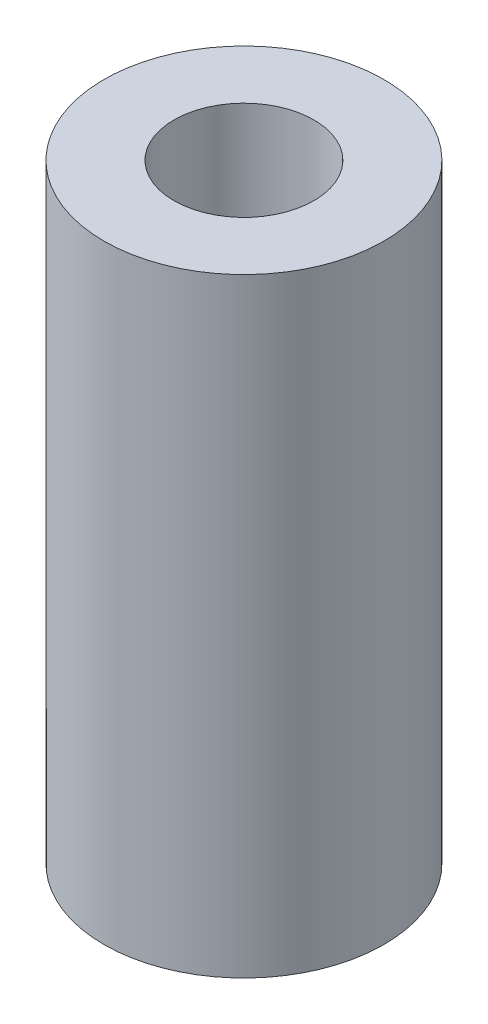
from build123d import *

# Parameters (mm, degrees)
SKETCH1_R           = 19.05
SKETCH1_R_2         = 9.525
BOSS_EXTRUDE1_DEPTH = 41.4528


with BuildPart() as part:
    # Sketch1 → Boss-Extrude1 (new, symmetric)
    with BuildSketch(Plane(origin=(0, 0, 0), x_dir=(1, 0, 0), z_dir=(0, 1, 0))):
        with Locations(Location((0, 0, 0), (0, 0, 270))):
            Circle(SKETCH1_R)
        with Locations(Location((0, 0, 0), (0, 0, 270))):
            Circle(SKETCH1_R_2, mode=Mode.SUBTRACT)
    extrude(amount=BOSS_EXTRUDE1_DEPTH, both=True)


solid = part.part
